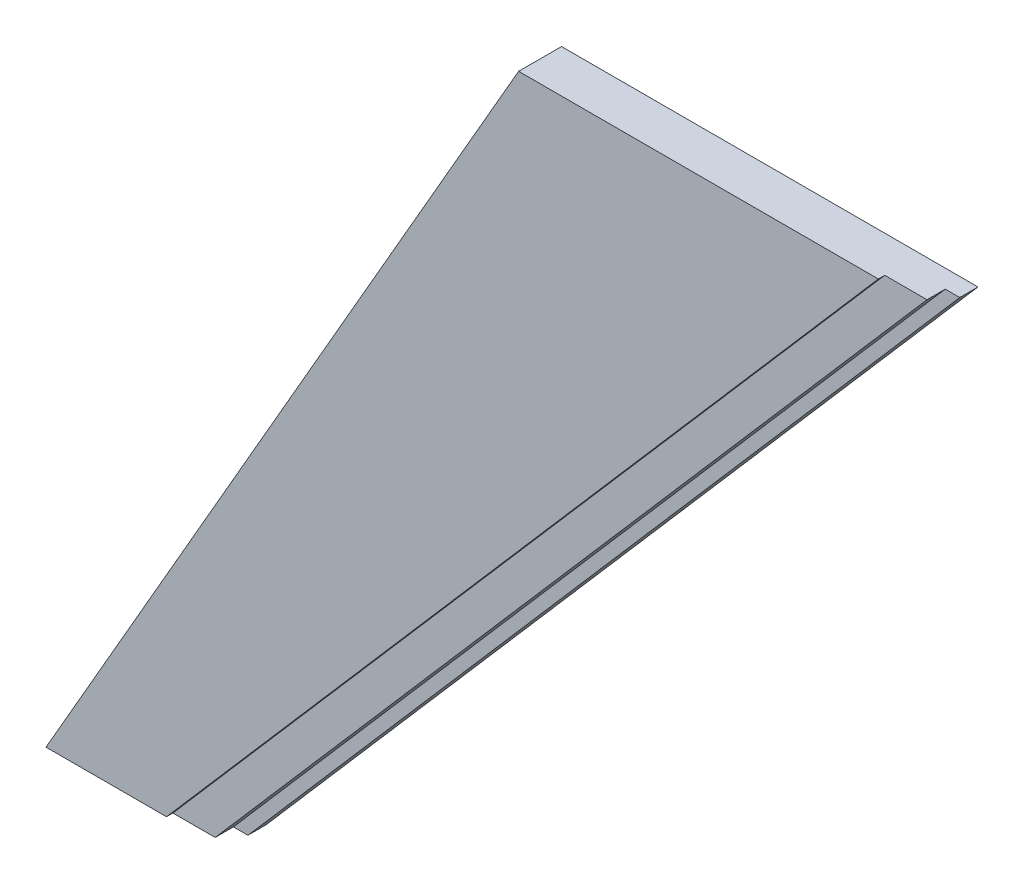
ISO-10303-21;
HEADER;
FILE_DESCRIPTION(('STEP AP214'),'2;1');
FILE_NAME('part.step','',(''),(''),'','','');
FILE_SCHEMA(('AUTOMOTIVE_DESIGN { 1 0 10303 214 1 1 1 1 }'));
ENDSEC;
DATA;
#1=APPLICATION_CONTEXT('core data for automotive mechanical design processes');
#2=APPLICATION_PROTOCOL_DEFINITION('international standard','automotive_design',2000,#1);
#3=PRODUCT_CONTEXT('',#1,'mechanical');
#4=PRODUCT('Part','Part','',(#3));
#5=PRODUCT_RELATED_PRODUCT_CATEGORY('part','',(#4));
#6=PRODUCT_DEFINITION_FORMATION('','',#4);
#7=PRODUCT_DEFINITION_CONTEXT('part definition',#1,'design');
#8=PRODUCT_DEFINITION('design','',#6,#7);
#9=PRODUCT_DEFINITION_SHAPE('','',#8);
#10=(LENGTH_UNIT() NAMED_UNIT(*) SI_UNIT(.MILLI.,.METRE.));
#11=(NAMED_UNIT(*) PLANE_ANGLE_UNIT() SI_UNIT($,.RADIAN.));
#12=(NAMED_UNIT(*) SI_UNIT($,.STERADIAN.) SOLID_ANGLE_UNIT());
#13=UNCERTAINTY_MEASURE_WITH_UNIT(LENGTH_MEASURE(1.E-05),#10,'distance_accuracy_value','');
#14=(GEOMETRIC_REPRESENTATION_CONTEXT(3) GLOBAL_UNCERTAINTY_ASSIGNED_CONTEXT((#13)) GLOBAL_UNIT_ASSIGNED_CONTEXT((#10,
#11,#12)) REPRESENTATION_CONTEXT('',''));
#15=CARTESIAN_POINT('',(0.,0.,0.));
#16=DIRECTION('',(0.,0.,1.));
#17=DIRECTION('',(1.,0.,0.));
#18=AXIS2_PLACEMENT_3D('',#15,#16,#17);
#19=CARTESIAN_POINT('',(-226.783248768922,0.,47.));
#20=DIRECTION('',(-0.755812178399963,0.654788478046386,0.));
#21=DIRECTION('',(-0.654788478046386,-0.755812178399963,0.));
#22=AXIS2_PLACEMENT_3D('',#19,#20,#21);
#23=PLANE('',#22);
#24=DIRECTION('',(0.,0.,-1.));
#25=VECTOR('',#24,1.);
#26=CARTESIAN_POINT('',(-1006.48705228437,-900.,47.));
#27=LINE('',#26,#25);
#28=CARTESIAN_POINT('',(-1006.48705228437,-900.,47.));
#29=VERTEX_POINT('',#28);
#30=CARTESIAN_POINT('',(-1006.48705228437,-900.,40.));
#31=VERTEX_POINT('',#30);
#32=EDGE_CURVE('E49',#29,#31,#27,.T.);
#33=ORIENTED_EDGE('',*,*,#32,.T.);
#34=DIRECTION('',(0.654788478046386,0.755812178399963,0.));
#35=VECTOR('',#34,1.);
#36=CARTESIAN_POINT('',(-226.783248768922,0.,40.));
#37=LINE('',#36,#35);
#38=CARTESIAN_POINT('',(-226.783248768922,0.,40.));
#39=VERTEX_POINT('',#38);
#40=EDGE_CURVE('E45',#31,#39,#37,.T.);
#41=ORIENTED_EDGE('',*,*,#40,.T.);
#42=DIRECTION('',(0.,0.,-1.));
#43=VECTOR('',#42,1.);
#44=CARTESIAN_POINT('',(-226.783248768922,0.,47.));
#45=LINE('',#44,#43);
#46=CARTESIAN_POINT('',(-226.783248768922,0.,47.));
#47=VERTEX_POINT('',#46);
#48=EDGE_CURVE('E11',#47,#39,#45,.T.);
#49=ORIENTED_EDGE('',*,*,#48,.F.);
#50=DIRECTION('',(0.654788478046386,0.755812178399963,0.));
#51=VECTOR('',#50,1.);
#52=CARTESIAN_POINT('',(-226.783248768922,0.,47.));
#53=LINE('',#52,#51);
#54=EDGE_CURVE('E147',#29,#47,#53,.T.);
#55=ORIENTED_EDGE('',*,*,#54,.F.);
#56=EDGE_LOOP('',(#33,#41,#49,#55));
#57=FACE_BOUND('',#56,.T.);
#58=ADVANCED_FACE('F31',(#57),#23,.F.);
#59=CARTESIAN_POINT('',(-226.783248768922,0.,47.));
#60=DIRECTION('',(0.,-1.,0.));
#61=DIRECTION('',(1.,0.,0.));
#62=AXIS2_PLACEMENT_3D('',#59,#60,#61);
#63=PLANE('',#62);
#64=DIRECTION('',(-1.,0.,0.));
#65=VECTOR('',#64,1.);
#66=CARTESIAN_POINT('',(-226.783248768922,0.,0.));
#67=LINE('',#66,#65);
#68=CARTESIAN_POINT('',(-164.598487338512,0.,0.));
#69=VERTEX_POINT('',#68);
#70=CARTESIAN_POINT('',(-620.780305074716,0.,0.));
#71=VERTEX_POINT('',#70);
#72=EDGE_CURVE('E94',#69,#71,#67,.T.);
#73=ORIENTED_EDGE('',*,*,#72,.T.);
#74=DIRECTION('',(0.,0.,-1.));
#75=VECTOR('',#74,1.);
#76=CARTESIAN_POINT('',(-620.780305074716,0.,47.));
#77=LINE('',#76,#75);
#78=CARTESIAN_POINT('',(-620.780305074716,0.,47.));
#79=VERTEX_POINT('',#78);
#80=EDGE_CURVE('E38',#79,#71,#77,.T.);
#81=ORIENTED_EDGE('',*,*,#80,.F.);
#82=DIRECTION('',(-1.,0.,0.));
#83=VECTOR('',#82,1.);
#84=CARTESIAN_POINT('',(-226.783248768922,0.,47.));
#85=LINE('',#84,#83);
#86=EDGE_CURVE('E150',#47,#79,#85,.T.);
#87=ORIENTED_EDGE('',*,*,#86,.F.);
#88=ORIENTED_EDGE('',*,*,#48,.T.);
#89=DIRECTION('',(1.,0.,0.));
#90=VECTOR('',#89,1.);
#91=CARTESIAN_POINT('',(-226.783248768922,0.,40.));
#92=LINE('',#91,#90);
#93=CARTESIAN_POINT('',(-180.475447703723,0.,40.));
#94=VERTEX_POINT('',#93);
#95=EDGE_CURVE('E131',#39,#94,#92,.T.);
#96=ORIENTED_EDGE('',*,*,#95,.T.);
#97=DIRECTION('',(0.,0.,-1.));
#98=VECTOR('',#97,1.);
#99=CARTESIAN_POINT('',(-180.475447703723,0.,40.));
#100=LINE('',#99,#98);
#101=CARTESIAN_POINT('',(-180.475447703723,0.,20.));
#102=VERTEX_POINT('',#101);
#103=EDGE_CURVE('E140',#94,#102,#100,.T.);
#104=ORIENTED_EDGE('',*,*,#103,.T.);
#105=DIRECTION('',(1.,0.,0.));
#106=VECTOR('',#105,1.);
#107=CARTESIAN_POINT('',(-180.475447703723,0.,20.));
#108=LINE('',#107,#106);
#109=CARTESIAN_POINT('',(-164.598487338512,0.,20.));
#110=VERTEX_POINT('',#109);
#111=EDGE_CURVE('E110',#102,#110,#108,.T.);
#112=ORIENTED_EDGE('',*,*,#111,.T.);
#113=DIRECTION('',(0.,0.,-1.));
#114=VECTOR('',#113,1.);
#115=CARTESIAN_POINT('',(-164.598487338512,0.,20.));
#116=LINE('',#115,#114);
#117=EDGE_CURVE('E107',#110,#69,#116,.T.);
#118=ORIENTED_EDGE('',*,*,#117,.T.);
#119=EDGE_LOOP('',(#73,#81,#87,#88,#96,#104,#112,#118));
#120=FACE_BOUND('',#119,.T.);
#121=ADVANCED_FACE('F108',(#120),#63,.F.);
#122=CARTESIAN_POINT('',(-620.780305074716,0.,47.));
#123=DIRECTION('',(0.866820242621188,-0.498620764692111,0.));
#124=DIRECTION('',(0.498620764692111,0.866820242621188,0.));
#125=AXIS2_PLACEMENT_3D('',#122,#123,#124);
#126=PLANE('',#125);
#127=DIRECTION('',(-0.498620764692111,-0.866820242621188,0.));
#128=VECTOR('',#127,1.);
#129=CARTESIAN_POINT('',(-620.780305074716,0.,0.));
#130=LINE('',#129,#128);
#131=CARTESIAN_POINT('',(-1138.48705228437,-900.000000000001,0.));
#132=VERTEX_POINT('',#131);
#133=EDGE_CURVE('E100',#71,#132,#130,.T.);
#134=ORIENTED_EDGE('',*,*,#133,.T.);
#135=DIRECTION('',(0.,0.,-1.));
#136=VECTOR('',#135,1.);
#137=CARTESIAN_POINT('',(-1138.48705228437,-900.000000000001,47.));
#138=LINE('',#137,#136);
#139=CARTESIAN_POINT('',(-1138.48705228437,-900.000000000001,47.));
#140=VERTEX_POINT('',#139);
#141=EDGE_CURVE('E157',#140,#132,#138,.T.);
#142=ORIENTED_EDGE('',*,*,#141,.F.);
#143=DIRECTION('',(-0.498620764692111,-0.866820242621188,0.));
#144=VECTOR('',#143,1.);
#145=CARTESIAN_POINT('',(-620.780305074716,0.,47.));
#146=LINE('',#145,#144);
#147=EDGE_CURVE('E152',#79,#140,#146,.T.);
#148=ORIENTED_EDGE('',*,*,#147,.F.);
#149=ORIENTED_EDGE('',*,*,#80,.T.);
#150=EDGE_LOOP('',(#134,#142,#148,#149));
#151=FACE_BOUND('',#150,.T.);
#152=ADVANCED_FACE('F161',(#151),#126,.F.);
#153=CARTESIAN_POINT('',(-1138.48705228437,-900.000000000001,47.));
#154=DIRECTION('',(0.,1.,0.));
#155=DIRECTION('',(-1.,0.,0.));
#156=AXIS2_PLACEMENT_3D('',#153,#154,#155);
#157=PLANE('',#156);
#158=DIRECTION('',(1.,0.,0.));
#159=VECTOR('',#158,1.);
#160=CARTESIAN_POINT('',(-1138.48705228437,-900.000000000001,0.));
#161=LINE('',#160,#159);
#162=CARTESIAN_POINT('',(-944.30229085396,-900.,0.));
#163=VERTEX_POINT('',#162);
#164=EDGE_CURVE('E145',#132,#163,#161,.T.);
#165=ORIENTED_EDGE('',*,*,#164,.T.);
#166=DIRECTION('',(0.,0.,-1.));
#167=VECTOR('',#166,1.);
#168=CARTESIAN_POINT('',(-944.30229085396,-900.,20.));
#169=LINE('',#168,#167);
#170=CARTESIAN_POINT('',(-944.30229085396,-900.,20.));
#171=VERTEX_POINT('',#170);
#172=EDGE_CURVE('E114',#171,#163,#169,.T.);
#173=ORIENTED_EDGE('',*,*,#172,.F.);
#174=DIRECTION('',(-1.,0.,0.));
#175=VECTOR('',#174,1.);
#176=CARTESIAN_POINT('',(-960.179251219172,-900.,20.));
#177=LINE('',#176,#175);
#178=CARTESIAN_POINT('',(-960.179251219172,-900.,20.));
#179=VERTEX_POINT('',#178);
#180=EDGE_CURVE('E115',#171,#179,#177,.T.);
#181=ORIENTED_EDGE('',*,*,#180,.T.);
#182=DIRECTION('',(0.,0.,-1.));
#183=VECTOR('',#182,1.);
#184=CARTESIAN_POINT('',(-960.179251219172,-900.,40.));
#185=LINE('',#184,#183);
#186=CARTESIAN_POINT('',(-960.179251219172,-900.,40.));
#187=VERTEX_POINT('',#186);
#188=EDGE_CURVE('E104',#187,#179,#185,.T.);
#189=ORIENTED_EDGE('',*,*,#188,.F.);
#190=DIRECTION('',(-1.,0.,0.));
#191=VECTOR('',#190,1.);
#192=CARTESIAN_POINT('',(-1006.48705228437,-900.,40.));
#193=LINE('',#192,#191);
#194=EDGE_CURVE('E137',#187,#31,#193,.T.);
#195=ORIENTED_EDGE('',*,*,#194,.T.);
#196=ORIENTED_EDGE('',*,*,#32,.F.);
#197=DIRECTION('',(1.,0.,0.));
#198=VECTOR('',#197,1.);
#199=CARTESIAN_POINT('',(-1138.48705228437,-900.000000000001,47.));
#200=LINE('',#199,#198);
#201=EDGE_CURVE('E154',#140,#29,#200,.T.);
#202=ORIENTED_EDGE('',*,*,#201,.F.);
#203=ORIENTED_EDGE('',*,*,#141,.T.);
#204=EDGE_LOOP('',(#165,#173,#181,#189,#195,#196,#202,#203));
#205=FACE_BOUND('',#204,.T.);
#206=ADVANCED_FACE('F174',(#205),#157,.F.);
#207=CARTESIAN_POINT('',(-226.783248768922,0.,47.));
#208=DIRECTION('',(0.,0.,-1.));
#209=DIRECTION('',(-1.,0.,0.));
#210=AXIS2_PLACEMENT_3D('',#207,#208,#209);
#211=PLANE('',#210);
#212=ORIENTED_EDGE('',*,*,#54,.T.);
#213=ORIENTED_EDGE('',*,*,#86,.T.);
#214=ORIENTED_EDGE('',*,*,#147,.T.);
#215=ORIENTED_EDGE('',*,*,#201,.T.);
#216=EDGE_LOOP('',(#212,#213,#214,#215));
#217=FACE_BOUND('',#216,.T.);
#218=ADVANCED_FACE('F165',(#217),#211,.F.);
#219=CARTESIAN_POINT('',(-226.783248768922,0.,0.));
#220=DIRECTION('',(0.,0.,-1.));
#221=DIRECTION('',(-1.,0.,0.));
#222=AXIS2_PLACEMENT_3D('',#219,#220,#221);
#223=PLANE('',#222);
#224=ORIENTED_EDGE('',*,*,#72,.F.);
#225=DIRECTION('',(-0.654788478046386,-0.755812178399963,0.));
#226=VECTOR('',#225,1.);
#227=CARTESIAN_POINT('',(-944.30229085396,-900.,0.));
#228=LINE('',#227,#226);
#229=EDGE_CURVE('E99',#69,#163,#228,.T.);
#230=ORIENTED_EDGE('',*,*,#229,.T.);
#231=ORIENTED_EDGE('',*,*,#164,.F.);
#232=ORIENTED_EDGE('',*,*,#133,.F.);
#233=EDGE_LOOP('',(#224,#230,#231,#232));
#234=FACE_BOUND('',#233,.T.);
#235=ADVANCED_FACE('F96',(#234),#223,.T.);
#236=CARTESIAN_POINT('',(-960.179251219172,-900.,40.));
#237=DIRECTION('',(0.755812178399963,-0.654788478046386,0.));
#238=DIRECTION('',(0.654788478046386,0.755812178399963,0.));
#239=AXIS2_PLACEMENT_3D('',#236,#237,#238);
#240=PLANE('',#239);
#241=DIRECTION('',(0.654788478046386,0.755812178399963,0.));
#242=VECTOR('',#241,1.);
#243=CARTESIAN_POINT('',(-180.475447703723,0.,20.));
#244=LINE('',#243,#242);
#245=EDGE_CURVE('E119',#179,#102,#244,.T.);
#246=ORIENTED_EDGE('',*,*,#245,.T.);
#247=ORIENTED_EDGE('',*,*,#103,.F.);
#248=DIRECTION('',(-0.654788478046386,-0.755812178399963,0.));
#249=VECTOR('',#248,1.);
#250=CARTESIAN_POINT('',(-960.179251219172,-900.,40.));
#251=LINE('',#250,#249);
#252=EDGE_CURVE('E134',#94,#187,#251,.T.);
#253=ORIENTED_EDGE('',*,*,#252,.T.);
#254=ORIENTED_EDGE('',*,*,#188,.T.);
#255=EDGE_LOOP('',(#246,#247,#253,#254));
#256=FACE_BOUND('',#255,.T.);
#257=ADVANCED_FACE('F184',(#256),#240,.T.);
#258=CARTESIAN_POINT('',(-1006.48705228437,-900.,40.));
#259=DIRECTION('',(0.,0.,1.));
#260=DIRECTION('',(1.,0.,0.));
#261=AXIS2_PLACEMENT_3D('',#258,#259,#260);
#262=PLANE('',#261);
#263=ORIENTED_EDGE('',*,*,#40,.F.);
#264=ORIENTED_EDGE('',*,*,#194,.F.);
#265=ORIENTED_EDGE('',*,*,#252,.F.);
#266=ORIENTED_EDGE('',*,*,#95,.F.);
#267=EDGE_LOOP('',(#263,#264,#265,#266));
#268=FACE_BOUND('',#267,.T.);
#269=ADVANCED_FACE('F187',(#268),#262,.T.);
#270=CARTESIAN_POINT('',(-944.30229085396,-900.,20.));
#271=DIRECTION('',(0.755812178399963,-0.654788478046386,0.));
#272=DIRECTION('',(0.654788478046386,0.755812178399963,0.));
#273=AXIS2_PLACEMENT_3D('',#270,#271,#272);
#274=PLANE('',#273);
#275=ORIENTED_EDGE('',*,*,#229,.F.);
#276=ORIENTED_EDGE('',*,*,#117,.F.);
#277=DIRECTION('',(-0.654788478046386,-0.755812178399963,0.));
#278=VECTOR('',#277,1.);
#279=CARTESIAN_POINT('',(-944.30229085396,-900.,20.));
#280=LINE('',#279,#278);
#281=EDGE_CURVE('E125',#110,#171,#280,.T.);
#282=ORIENTED_EDGE('',*,*,#281,.T.);
#283=ORIENTED_EDGE('',*,*,#172,.T.);
#284=EDGE_LOOP('',(#275,#276,#282,#283));
#285=FACE_BOUND('',#284,.T.);
#286=ADVANCED_FACE('F118',(#285),#274,.T.);
#287=CARTESIAN_POINT('',(-960.179251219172,-900.,20.));
#288=DIRECTION('',(0.,0.,1.));
#289=DIRECTION('',(1.,0.,0.));
#290=AXIS2_PLACEMENT_3D('',#287,#288,#289);
#291=PLANE('',#290);
#292=ORIENTED_EDGE('',*,*,#245,.F.);
#293=ORIENTED_EDGE('',*,*,#180,.F.);
#294=ORIENTED_EDGE('',*,*,#281,.F.);
#295=ORIENTED_EDGE('',*,*,#111,.F.);
#296=EDGE_LOOP('',(#292,#293,#294,#295));
#297=FACE_BOUND('',#296,.T.);
#298=ADVANCED_FACE('F194',(#297),#291,.T.);
#299=CLOSED_SHELL('',(#58,#121,#152,#206,#218,#235,#257,#269,#286,#298));
#300=MANIFOLD_SOLID_BREP('B2',#299);
#301=ADVANCED_BREP_SHAPE_REPRESENTATION('',(#18,#300),#14);
#302=SHAPE_DEFINITION_REPRESENTATION(#9,#301);
ENDSEC;
END-ISO-10303-21;
